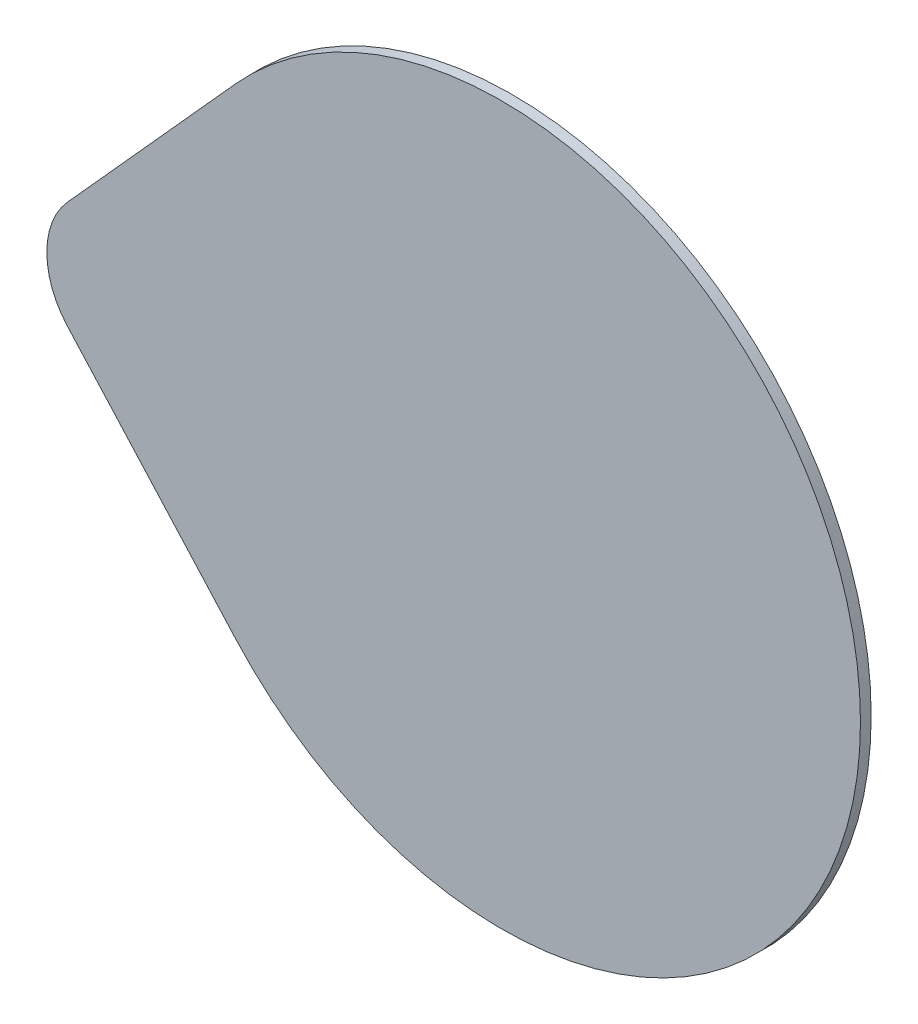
ISO-10303-21;
HEADER;
FILE_DESCRIPTION(('STEP AP214'),'2;1');
FILE_NAME('part.step','',(''),(''),'','','');
FILE_SCHEMA(('AUTOMOTIVE_DESIGN { 1 0 10303 214 1 1 1 1 }'));
ENDSEC;
DATA;
#1=APPLICATION_CONTEXT('core data for automotive mechanical design processes');
#2=APPLICATION_PROTOCOL_DEFINITION('international standard','automotive_design',2000,#1);
#3=PRODUCT_CONTEXT('',#1,'mechanical');
#4=PRODUCT('Part','Part','',(#3));
#5=PRODUCT_RELATED_PRODUCT_CATEGORY('part','',(#4));
#6=PRODUCT_DEFINITION_FORMATION('','',#4);
#7=PRODUCT_DEFINITION_CONTEXT('part definition',#1,'design');
#8=PRODUCT_DEFINITION('design','',#6,#7);
#9=PRODUCT_DEFINITION_SHAPE('','',#8);
#10=(LENGTH_UNIT() NAMED_UNIT(*) SI_UNIT(.MILLI.,.METRE.));
#11=(NAMED_UNIT(*) PLANE_ANGLE_UNIT() SI_UNIT($,.RADIAN.));
#12=(NAMED_UNIT(*) SI_UNIT($,.STERADIAN.) SOLID_ANGLE_UNIT());
#13=UNCERTAINTY_MEASURE_WITH_UNIT(LENGTH_MEASURE(1.E-05),#10,'distance_accuracy_value','');
#14=(GEOMETRIC_REPRESENTATION_CONTEXT(3) GLOBAL_UNCERTAINTY_ASSIGNED_CONTEXT((#13)) GLOBAL_UNIT_ASSIGNED_CONTEXT((#10,
#11,#12)) REPRESENTATION_CONTEXT('',''));
#15=CARTESIAN_POINT('',(0.,0.,0.));
#16=DIRECTION('',(0.,0.,1.));
#17=DIRECTION('',(1.,0.,0.));
#18=AXIS2_PLACEMENT_3D('',#15,#16,#17);
#19=CARTESIAN_POINT('',(-35.,0.,1.));
#20=DIRECTION('',(0.,0.,-1.));
#21=DIRECTION('',(-1.,0.,0.));
#22=AXIS2_PLACEMENT_3D('',#19,#20,#21);
#23=CYLINDRICAL_SURFACE('',#22,7.5);
#24=CARTESIAN_POINT('',(-35.,0.,0.));
#25=DIRECTION('',(0.,0.,1.));
#26=DIRECTION('',(1.,0.,0.));
#27=AXIS2_PLACEMENT_3D('',#24,#25,#26);
#28=CIRCLE('',#27,7.5);
#29=CARTESIAN_POINT('',(-40.5714285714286,5.02087479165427,0.));
#30=VERTEX_POINT('',#29);
#31=CARTESIAN_POINT('',(-40.5714285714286,-5.02087479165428,0.));
#32=VERTEX_POINT('',#31);
#33=EDGE_CURVE('E68',#30,#32,#28,.T.);
#34=ORIENTED_EDGE('',*,*,#33,.T.);
#35=DIRECTION('',(0.,0.,-1.));
#36=VECTOR('',#35,1.);
#37=CARTESIAN_POINT('',(-40.5714285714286,-5.02087479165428,1.));
#38=LINE('',#37,#36);
#39=CARTESIAN_POINT('',(-40.5714285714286,-5.02087479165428,1.));
#40=VERTEX_POINT('',#39);
#41=EDGE_CURVE('E11',#40,#32,#38,.T.);
#42=ORIENTED_EDGE('',*,*,#41,.F.);
#43=CARTESIAN_POINT('',(-35.,0.,1.));
#44=DIRECTION('',(0.,0.,1.));
#45=DIRECTION('',(1.,0.,0.));
#46=AXIS2_PLACEMENT_3D('',#43,#44,#45);
#47=CIRCLE('',#46,7.5);
#48=CARTESIAN_POINT('',(-40.5714285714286,5.02087479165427,1.));
#49=VERTEX_POINT('',#48);
#50=EDGE_CURVE('E86',#49,#40,#47,.T.);
#51=ORIENTED_EDGE('',*,*,#50,.F.);
#52=DIRECTION('',(0.,0.,-1.));
#53=VECTOR('',#52,1.);
#54=CARTESIAN_POINT('',(-40.5714285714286,5.02087479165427,1.));
#55=LINE('',#54,#53);
#56=EDGE_CURVE('E80',#49,#30,#55,.T.);
#57=ORIENTED_EDGE('',*,*,#56,.T.);
#58=EDGE_LOOP('',(#34,#42,#51,#57));
#59=FACE_BOUND('',#58,.T.);
#60=ADVANCED_FACE('F24',(#59),#23,.T.);
#61=CARTESIAN_POINT('',(-40.5714285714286,-5.02087479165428,1.));
#62=DIRECTION('',(0.742857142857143,0.669449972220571,0.));
#63=DIRECTION('',(-0.669449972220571,0.742857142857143,0.));
#64=AXIS2_PLACEMENT_3D('',#61,#62,#63);
#65=PLANE('',#64);
#66=DIRECTION('',(0.669449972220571,-0.742857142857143,0.));
#67=VECTOR('',#66,1.);
#68=CARTESIAN_POINT('',(-40.5714285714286,-5.02087479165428,0.));
#69=LINE('',#68,#67);
#70=CARTESIAN_POINT('',(-24.8857142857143,-22.4265740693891,0.));
#71=VERTEX_POINT('',#70);
#72=EDGE_CURVE('E64',#32,#71,#69,.T.);
#73=ORIENTED_EDGE('',*,*,#72,.T.);
#74=DIRECTION('',(0.,0.,-1.));
#75=VECTOR('',#74,1.);
#76=CARTESIAN_POINT('',(-24.8857142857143,-22.4265740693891,1.));
#77=LINE('',#76,#75);
#78=CARTESIAN_POINT('',(-24.8857142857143,-22.4265740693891,1.));
#79=VERTEX_POINT('',#78);
#80=EDGE_CURVE('E31',#79,#71,#77,.T.);
#81=ORIENTED_EDGE('',*,*,#80,.F.);
#82=DIRECTION('',(0.669449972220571,-0.742857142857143,0.));
#83=VECTOR('',#82,1.);
#84=CARTESIAN_POINT('',(-40.5714285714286,-5.02087479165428,1.));
#85=LINE('',#84,#83);
#86=EDGE_CURVE('E76',#40,#79,#85,.T.);
#87=ORIENTED_EDGE('',*,*,#86,.F.);
#88=ORIENTED_EDGE('',*,*,#41,.T.);
#89=EDGE_LOOP('',(#73,#81,#87,#88));
#90=FACE_BOUND('',#89,.T.);
#91=ADVANCED_FACE('F75',(#90),#65,.F.);
#92=CARTESIAN_POINT('',(0.,0.,1.));
#93=DIRECTION('',(0.,0.,-1.));
#94=DIRECTION('',(-1.,0.,0.));
#95=AXIS2_PLACEMENT_3D('',#92,#93,#94);
#96=CYLINDRICAL_SURFACE('',#95,33.5);
#97=CARTESIAN_POINT('',(0.,0.,0.));
#98=DIRECTION('',(0.,0.,1.));
#99=DIRECTION('',(1.,0.,0.));
#100=AXIS2_PLACEMENT_3D('',#97,#98,#99);
#101=CIRCLE('',#100,33.5);
#102=CARTESIAN_POINT('',(-24.8857142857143,22.4265740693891,0.));
#103=VERTEX_POINT('',#102);
#104=EDGE_CURVE('E69',#71,#103,#101,.T.);
#105=ORIENTED_EDGE('',*,*,#104,.T.);
#106=DIRECTION('',(0.,0.,-1.));
#107=VECTOR('',#106,1.);
#108=CARTESIAN_POINT('',(-24.8857142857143,22.4265740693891,1.));
#109=LINE('',#108,#107);
#110=CARTESIAN_POINT('',(-24.8857142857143,22.4265740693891,1.));
#111=VERTEX_POINT('',#110);
#112=EDGE_CURVE('E92',#111,#103,#109,.T.);
#113=ORIENTED_EDGE('',*,*,#112,.F.);
#114=CARTESIAN_POINT('',(0.,0.,1.));
#115=DIRECTION('',(0.,0.,1.));
#116=DIRECTION('',(1.,0.,0.));
#117=AXIS2_PLACEMENT_3D('',#114,#115,#116);
#118=CIRCLE('',#117,33.5);
#119=EDGE_CURVE('E43',#79,#111,#118,.T.);
#120=ORIENTED_EDGE('',*,*,#119,.F.);
#121=ORIENTED_EDGE('',*,*,#80,.T.);
#122=EDGE_LOOP('',(#105,#113,#120,#121));
#123=FACE_BOUND('',#122,.T.);
#124=ADVANCED_FACE('F95',(#123),#96,.T.);
#125=CARTESIAN_POINT('',(-40.5714285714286,5.02087479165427,1.));
#126=DIRECTION('',(0.742857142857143,-0.66944997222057,0.));
#127=DIRECTION('',(0.66944997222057,0.742857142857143,0.));
#128=AXIS2_PLACEMENT_3D('',#125,#126,#127);
#129=PLANE('',#128);
#130=DIRECTION('',(-0.66944997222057,-0.742857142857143,0.));
#131=VECTOR('',#130,1.);
#132=CARTESIAN_POINT('',(-40.5714285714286,5.02087479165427,0.));
#133=LINE('',#132,#131);
#134=EDGE_CURVE('E84',#103,#30,#133,.T.);
#135=ORIENTED_EDGE('',*,*,#134,.T.);
#136=ORIENTED_EDGE('',*,*,#56,.F.);
#137=DIRECTION('',(-0.66944997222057,-0.742857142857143,0.));
#138=VECTOR('',#137,1.);
#139=CARTESIAN_POINT('',(-40.5714285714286,5.02087479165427,1.));
#140=LINE('',#139,#138);
#141=EDGE_CURVE('E38',#111,#49,#140,.T.);
#142=ORIENTED_EDGE('',*,*,#141,.F.);
#143=ORIENTED_EDGE('',*,*,#112,.T.);
#144=EDGE_LOOP('',(#135,#136,#142,#143));
#145=FACE_BOUND('',#144,.T.);
#146=ADVANCED_FACE('F97',(#145),#129,.F.);
#147=CARTESIAN_POINT('',(-35.,0.,1.));
#148=DIRECTION('',(0.,0.,1.));
#149=DIRECTION('',(1.,0.,0.));
#150=AXIS2_PLACEMENT_3D('',#147,#148,#149);
#151=PLANE('',#150);
#152=ORIENTED_EDGE('',*,*,#50,.T.);
#153=ORIENTED_EDGE('',*,*,#86,.T.);
#154=ORIENTED_EDGE('',*,*,#119,.T.);
#155=ORIENTED_EDGE('',*,*,#141,.T.);
#156=EDGE_LOOP('',(#152,#153,#154,#155));
#157=FACE_BOUND('',#156,.T.);
#158=ADVANCED_FACE('F98',(#157),#151,.T.);
#159=CARTESIAN_POINT('',(-35.,0.,0.));
#160=DIRECTION('',(0.,0.,1.));
#161=DIRECTION('',(1.,0.,0.));
#162=AXIS2_PLACEMENT_3D('',#159,#160,#161);
#163=PLANE('',#162);
#164=ORIENTED_EDGE('',*,*,#33,.F.);
#165=ORIENTED_EDGE('',*,*,#134,.F.);
#166=ORIENTED_EDGE('',*,*,#104,.F.);
#167=ORIENTED_EDGE('',*,*,#72,.F.);
#168=EDGE_LOOP('',(#164,#165,#166,#167));
#169=FACE_BOUND('',#168,.T.);
#170=ADVANCED_FACE('F65',(#169),#163,.F.);
#171=CLOSED_SHELL('',(#60,#91,#124,#146,#158,#170));
#172=MANIFOLD_SOLID_BREP('B2',#171);
#173=ADVANCED_BREP_SHAPE_REPRESENTATION('',(#18,#172),#14);
#174=SHAPE_DEFINITION_REPRESENTATION(#9,#173);
ENDSEC;
END-ISO-10303-21;
